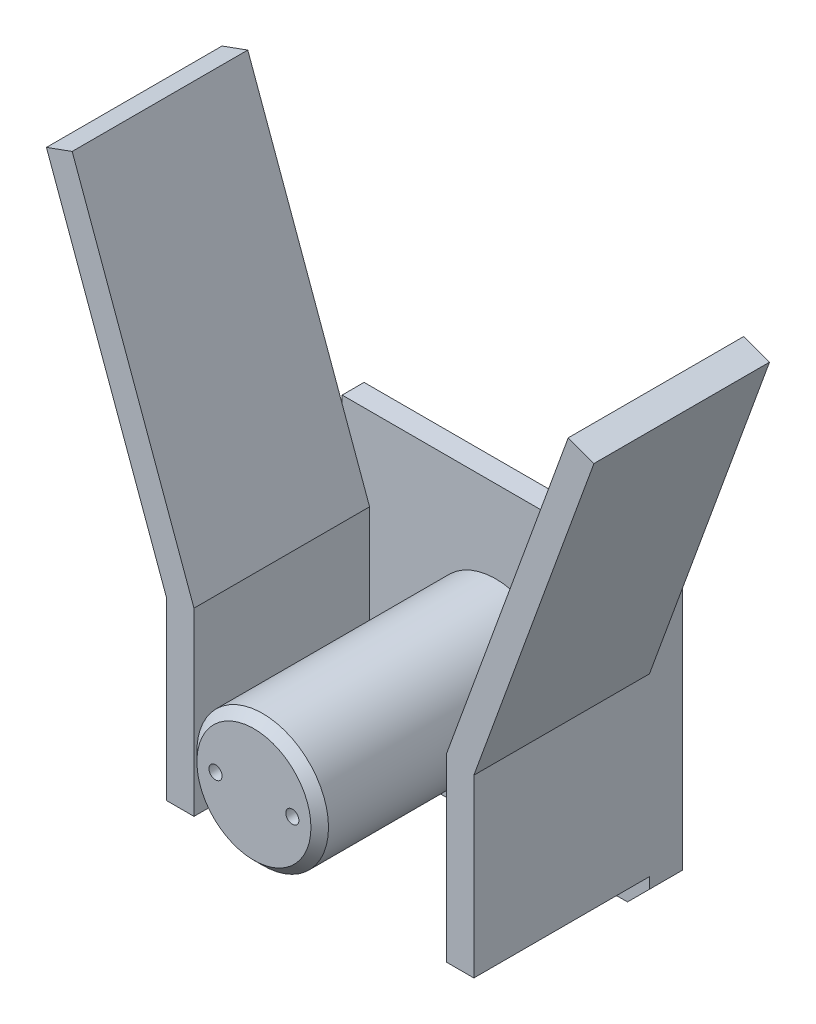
from build123d import *

# Parameters (mm, degrees)
SKETCH1_W           = 88.9
SKETCH1_H           = 85.725
BASE_EXTRUDE_DEPTH  = 9.525
SKETCH2_R           = 19.0373
BOSS_EXTRUDE1_DEPTH = 69.977
CHAMFER2_SIZE       = 6.35
CHAMFER3_SIZE       = 3.175
CHAMFER4_SIZE       = 2.54
CIRPATTERN1_COUNT   = 2
SKETCH13_R          = 3.556
CUT_EXTRUDE4_DEPTH  = 120.253338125
LPATTERN1_COUNT     = 2
LPATTERN1_PITCH     = 22.225
EXTRUDE2_DEPTH      = 50.8


with BuildPart() as part:
    # Sketch1 → Base-Extrude (new body)
    with BuildSketch(Plane.XY):
        with Locations((0, -42.8625)):
            Rectangle(SKETCH1_W, SKETCH1_H)
    extrude(amount=BASE_EXTRUDE_DEPTH)

    # Sketch2 → Boss-Extrude1 (add)
    with BuildSketch(Plane.XY.offset(9.525)):
        with Locations((0, -42.8625)):
            Circle(SKETCH2_R)
    extrude(amount=BOSS_EXTRUDE1_DEPTH)

    # Chamfer2
    chamfer2_edges = [part.edges().sort_by_distance(p)[0] for p in [
        (44.45, -85.725, 4.7625),
        (-44.45, -85.725, 4.7625),
    ]]
    chamfer(chamfer2_edges, length=CHAMFER2_SIZE)

    # Chamfer3
    chamfer3_edges = [part.edges().sort_by_distance(p)[0] for p in [
        (0, 0, 0),
    ]]
    chamfer(chamfer3_edges, length=CHAMFER3_SIZE)

    # Chamfer4
    chamfer4_edges = [part.edges().sort_by_distance(p)[0] for p in [
        (-19.0373, -42.8625, 79.502),
    ]]
    chamfer(chamfer4_edges, length=CHAMFER4_SIZE)

    # Sketch8 → Hole3 (revolve, cut)
    with BuildSketch(Plane(origin=(11.1125, -42.8625, 79.502), x_dir=(0, -1, 0), z_dir=(1, 0, 0))):
        Polygon((0, 0), (0, 20.190831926), (1.898648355, 19.0500089), (1.898648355, 0), align=None)
    hole3 = revolve(axis=Axis((11.1125, -42.8625, 85.852), (0, 0, -1)), mode=Mode.SUBTRACT)

    # CirPattern1: Hole3 ×2 about axis
    cirpattern1_axis = Axis((0, -42.8625, 0), (0, 0, 1))
    for i in range(1, CIRPATTERN1_COUNT):
        add(hole3.rotate(cirpattern1_axis, i * 360 / CIRPATTERN1_COUNT), mode=Mode.SUBTRACT)

    # Sketch13 → Cut-Extrude4 (cut, through all)
    with BuildSketch(Plane.XY.offset(9.525)):
        with Locations((-31.75, -77.7875)):
            Circle(SKETCH13_R)
        with Locations((31.75, -77.7875)):
            Circle(SKETCH13_R)
    cut_extrude4 = extrude(amount=-CUT_EXTRUDE4_DEPTH, mode=Mode.SUBTRACT)

    # LPattern1: Cut-Extrude4 ×2
    with Locations(*[(0, i * LPATTERN1_PITCH, 0) for i in range(1, LPATTERN1_COUNT)]):
        add(cut_extrude4, mode=Mode.SUBTRACT)

    # Sketch14 → Extrude2 (add)
    with BuildSketch(Plane.XY.offset(9.525)):
        Polygon((-44.45, -25.4), (-79.199246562, 70.072770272), (-71.752370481, 72.783211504), (-36.51504, -24.030558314), (-36.51504, -76.2), (-44.45, -76.2), align=None)
    extrude2 = extrude(amount=EXTRUDE2_DEPTH)

    # Mirror2: Extrude2 across plane
    add(extrude2.mirror(Plane(origin=(0, 0, 0), x_dir=(0, 0, 1), z_dir=(1, 0, 0))))


solid = part.part
